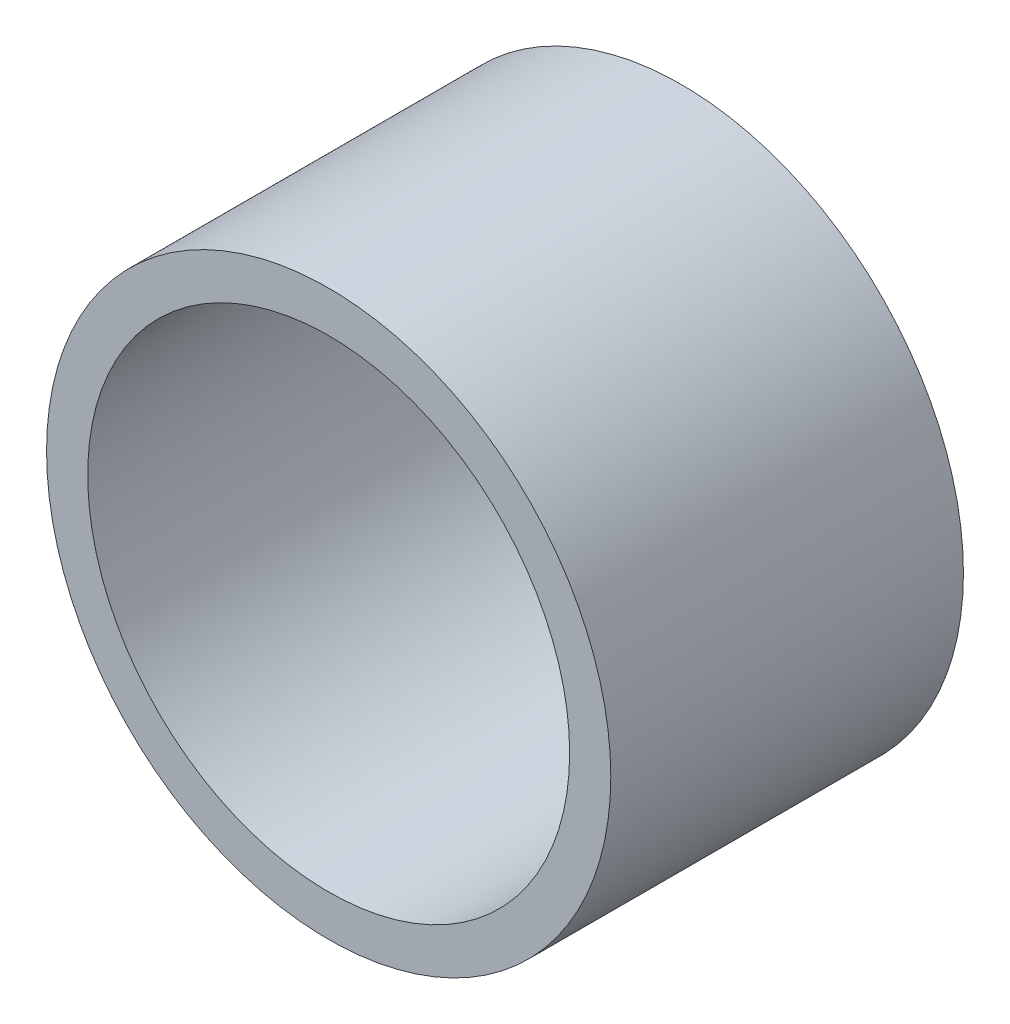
from build123d import *

# Parameters (mm, degrees)
SKETCH1_R           = 12
SKETCH1_R_2         = 10.25
BOSS_EXTRUDE1_DEPTH = 15


with BuildPart() as part:
    # Sketch1 → Boss-Extrude1 (new body)
    with BuildSketch(Plane.XY):
        Circle(SKETCH1_R)
        Circle(SKETCH1_R_2, mode=Mode.SUBTRACT)
    extrude(amount=BOSS_EXTRUDE1_DEPTH)


solid = part.part
